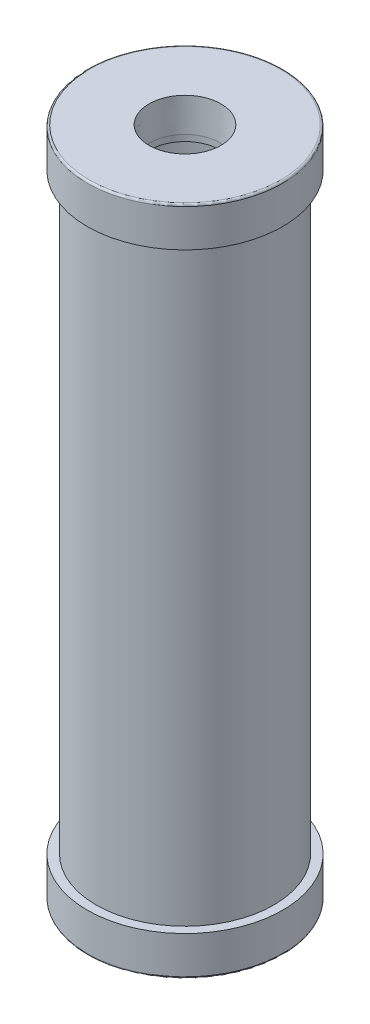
ISO-10303-21;
HEADER;
FILE_DESCRIPTION(('STEP AP214'),'2;1');
FILE_NAME('part.step','',(''),(''),'','','');
FILE_SCHEMA(('AUTOMOTIVE_DESIGN { 1 0 10303 214 1 1 1 1 }'));
ENDSEC;
DATA;
#1=APPLICATION_CONTEXT('core data for automotive mechanical design processes');
#2=APPLICATION_PROTOCOL_DEFINITION('international standard','automotive_design',2000,#1);
#3=PRODUCT_CONTEXT('',#1,'mechanical');
#4=PRODUCT('Part','Part','',(#3));
#5=PRODUCT_RELATED_PRODUCT_CATEGORY('part','',(#4));
#6=PRODUCT_DEFINITION_FORMATION('','',#4);
#7=PRODUCT_DEFINITION_CONTEXT('part definition',#1,'design');
#8=PRODUCT_DEFINITION('design','',#6,#7);
#9=PRODUCT_DEFINITION_SHAPE('','',#8);
#10=(LENGTH_UNIT() NAMED_UNIT(*) SI_UNIT(.MILLI.,.METRE.));
#11=(NAMED_UNIT(*) PLANE_ANGLE_UNIT() SI_UNIT($,.RADIAN.));
#12=(NAMED_UNIT(*) SI_UNIT($,.STERADIAN.) SOLID_ANGLE_UNIT());
#13=UNCERTAINTY_MEASURE_WITH_UNIT(LENGTH_MEASURE(1.E-05),#10,'distance_accuracy_value','');
#14=(GEOMETRIC_REPRESENTATION_CONTEXT(3) GLOBAL_UNCERTAINTY_ASSIGNED_CONTEXT((#13)) GLOBAL_UNIT_ASSIGNED_CONTEXT((#10,
#11,#12)) REPRESENTATION_CONTEXT('',''));
#15=CARTESIAN_POINT('',(0.,0.,0.));
#16=DIRECTION('',(0.,0.,1.));
#17=DIRECTION('',(1.,0.,0.));
#18=AXIS2_PLACEMENT_3D('',#15,#16,#17);
#19=CARTESIAN_POINT('',(0.,431.8,0.));
#20=DIRECTION('',(0.,-1.,0.));
#21=DIRECTION('',(0.,0.,-1.));
#22=AXIS2_PLACEMENT_3D('',#19,#20,#21);
#23=CYLINDRICAL_SURFACE('',#22,57.15);
#24=CARTESIAN_POINT('',(0.,25.4,0.));
#25=DIRECTION('',(0.,1.,0.));
#26=DIRECTION('',(0.,0.,1.));
#27=AXIS2_PLACEMENT_3D('',#24,#25,#26);
#28=CIRCLE('',#27,57.15);
#29=CARTESIAN_POINT('',(0.,25.4,57.15));
#30=VERTEX_POINT('',#29);
#31=EDGE_CURVE('E71',#30,#30,#28,.T.);
#32=ORIENTED_EDGE('',*,*,#31,.T.);
#33=EDGE_LOOP('',(#32));
#34=FACE_BOUND('',#33,.T.);
#35=CARTESIAN_POINT('',(0.,406.4,0.));
#36=DIRECTION('',(0.,1.,0.));
#37=DIRECTION('',(0.,0.,1.));
#38=AXIS2_PLACEMENT_3D('',#35,#36,#37);
#39=CIRCLE('',#38,57.15);
#40=CARTESIAN_POINT('',(0.,406.4,57.15));
#41=VERTEX_POINT('',#40);
#42=EDGE_CURVE('E53',#41,#41,#39,.T.);
#43=ORIENTED_EDGE('',*,*,#42,.F.);
#44=EDGE_LOOP('',(#43));
#45=FACE_BOUND('',#44,.T.);
#46=ADVANCED_FACE('F33',(#34,#45),#23,.T.);
#47=CARTESIAN_POINT('',(0.,431.8,0.));
#48=DIRECTION('',(0.,-1.,0.));
#49=DIRECTION('',(0.,0.,-1.));
#50=AXIS2_PLACEMENT_3D('',#47,#48,#49);
#51=CYLINDRICAL_SURFACE('',#50,50.546);
#52=CARTESIAN_POINT('',(0.,25.4,0.));
#53=DIRECTION('',(0.,1.,0.));
#54=DIRECTION('',(0.,0.,1.));
#55=AXIS2_PLACEMENT_3D('',#52,#53,#54);
#56=CIRCLE('',#55,50.546);
#57=CARTESIAN_POINT('',(0.,25.4,50.546));
#58=VERTEX_POINT('',#57);
#59=EDGE_CURVE('E68',#58,#58,#56,.T.);
#60=ORIENTED_EDGE('',*,*,#59,.F.);
#61=EDGE_LOOP('',(#60));
#62=FACE_BOUND('',#61,.T.);
#63=CARTESIAN_POINT('',(0.,406.4,0.));
#64=DIRECTION('',(0.,1.,0.));
#65=DIRECTION('',(0.,0.,1.));
#66=AXIS2_PLACEMENT_3D('',#63,#64,#65);
#67=CIRCLE('',#66,50.546);
#68=CARTESIAN_POINT('',(0.,406.4,50.546));
#69=VERTEX_POINT('',#68);
#70=EDGE_CURVE('E59',#69,#69,#67,.T.);
#71=ORIENTED_EDGE('',*,*,#70,.T.);
#72=EDGE_LOOP('',(#71));
#73=FACE_BOUND('',#72,.T.);
#74=ADVANCED_FACE('F115',(#62,#73),#51,.F.);
#75=CARTESIAN_POINT('',(0.,25.4,0.));
#76=DIRECTION('',(0.,1.,0.));
#77=DIRECTION('',(0.,0.,1.));
#78=AXIS2_PLACEMENT_3D('',#75,#76,#77);
#79=PLANE('',#78);
#80=CARTESIAN_POINT('',(0.,25.4,0.));
#81=DIRECTION('',(0.,1.,0.));
#82=DIRECTION('',(0.,0.,1.));
#83=AXIS2_PLACEMENT_3D('',#80,#81,#82);
#84=CIRCLE('',#83,22.6);
#85=CARTESIAN_POINT('',(0.,25.4,22.6));
#86=VERTEX_POINT('',#85);
#87=EDGE_CURVE('E63',#86,#86,#84,.T.);
#88=ORIENTED_EDGE('',*,*,#87,.F.);
#89=EDGE_LOOP('',(#88));
#90=FACE_BOUND('',#89,.T.);
#91=ORIENTED_EDGE('',*,*,#59,.T.);
#92=EDGE_LOOP('',(#91));
#93=FACE_BOUND('',#92,.T.);
#94=ADVANCED_FACE('F121',(#90,#93),#79,.T.);
#95=CARTESIAN_POINT('',(0.,25.4,0.));
#96=DIRECTION('',(0.,1.,0.));
#97=DIRECTION('',(0.,0.,1.));
#98=AXIS2_PLACEMENT_3D('',#95,#96,#97);
#99=CIRCLE('',#98,62.865);
#100=CARTESIAN_POINT('',(0.,25.4,62.865));
#101=VERTEX_POINT('',#100);
#102=EDGE_CURVE('E66',#101,#101,#99,.T.);
#103=ORIENTED_EDGE('',*,*,#102,.T.);
#104=EDGE_LOOP('',(#103));
#105=FACE_BOUND('',#104,.T.);
#106=ORIENTED_EDGE('',*,*,#31,.F.);
#107=EDGE_LOOP('',(#106));
#108=FACE_BOUND('',#107,.T.);
#109=ADVANCED_FACE('F142',(#105,#108),#79,.T.);
#110=CARTESIAN_POINT('',(0.,25.4,0.));
#111=DIRECTION('',(0.,-1.,0.));
#112=DIRECTION('',(0.,0.,-1.));
#113=AXIS2_PLACEMENT_3D('',#110,#111,#112);
#114=CYLINDRICAL_SURFACE('',#113,62.865);
#115=CARTESIAN_POINT('',(0.,1.27,0.));
#116=DIRECTION('',(0.,1.,0.));
#117=DIRECTION('',(0.,0.,1.));
#118=AXIS2_PLACEMENT_3D('',#115,#116,#117);
#119=CIRCLE('',#118,62.865);
#120=CARTESIAN_POINT('',(0.,1.27,62.865));
#121=VERTEX_POINT('',#120);
#122=EDGE_CURVE('E48',#121,#121,#119,.T.);
#123=ORIENTED_EDGE('',*,*,#122,.T.);
#124=EDGE_LOOP('',(#123));
#125=FACE_BOUND('',#124,.T.);
#126=ORIENTED_EDGE('',*,*,#102,.F.);
#127=EDGE_LOOP('',(#126));
#128=FACE_BOUND('',#127,.T.);
#129=ADVANCED_FACE('F139',(#125,#128),#114,.T.);
#130=CARTESIAN_POINT('',(0.,0.,0.));
#131=DIRECTION('',(0.,1.,0.));
#132=DIRECTION('',(0.,0.,1.));
#133=AXIS2_PLACEMENT_3D('',#130,#131,#132);
#134=PLANE('',#133);
#135=CARTESIAN_POINT('',(0.,0.,0.));
#136=DIRECTION('',(0.,1.,0.));
#137=DIRECTION('',(0.,0.,1.));
#138=AXIS2_PLACEMENT_3D('',#135,#136,#137);
#139=CIRCLE('',#138,61.595);
#140=CARTESIAN_POINT('',(0.,0.,61.595));
#141=VERTEX_POINT('',#140);
#142=EDGE_CURVE('E44',#141,#141,#139,.F.);
#143=ORIENTED_EDGE('',*,*,#142,.T.);
#144=EDGE_LOOP('',(#143));
#145=FACE_BOUND('',#144,.T.);
#146=CARTESIAN_POINT('',(0.,0.,0.));
#147=DIRECTION('',(0.,-1.,0.));
#148=DIRECTION('',(0.,0.,-1.));
#149=AXIS2_PLACEMENT_3D('',#146,#147,#148);
#150=CIRCLE('',#149,23.160002);
#151=CARTESIAN_POINT('',(0.,0.,-23.160002));
#152=VERTEX_POINT('',#151);
#153=EDGE_CURVE('E62',#152,#152,#150,.T.);
#154=ORIENTED_EDGE('',*,*,#153,.F.);
#155=EDGE_LOOP('',(#154));
#156=FACE_BOUND('',#155,.T.);
#157=ADVANCED_FACE('F124',(#145,#156),#134,.F.);
#158=CARTESIAN_POINT('',(0.,0.,0.));
#159=DIRECTION('',(0.,-1.,0.));
#160=DIRECTION('',(0.,0.,-1.));
#161=AXIS2_PLACEMENT_3D('',#158,#159,#160);
#162=CYLINDRICAL_SURFACE('',#161,22.6);
#163=ORIENTED_EDGE('',*,*,#87,.T.);
#164=EDGE_LOOP('',(#163));
#165=FACE_BOUND('',#164,.T.);
#166=CARTESIAN_POINT('',(0.,21.336,0.));
#167=DIRECTION('',(0.,-1.,0.));
#168=DIRECTION('',(0.,0.,-1.));
#169=AXIS2_PLACEMENT_3D('',#166,#167,#168);
#170=CIRCLE('',#169,22.6);
#171=CARTESIAN_POINT('',(0.,21.336,-22.6));
#172=VERTEX_POINT('',#171);
#173=EDGE_CURVE('E67',#172,#172,#170,.T.);
#174=ORIENTED_EDGE('',*,*,#173,.T.);
#175=EDGE_LOOP('',(#174));
#176=FACE_BOUND('',#175,.T.);
#177=ADVANCED_FACE('F155',(#165,#176),#162,.F.);
#178=CARTESIAN_POINT('',(22.6,21.336,0.));
#179=DIRECTION('',(0.,-1.,0.));
#180=DIRECTION('',(0.,0.,-1.));
#181=AXIS2_PLACEMENT_3D('',#178,#179,#180);
#182=PLANE('',#181);
#183=ORIENTED_EDGE('',*,*,#173,.F.);
#184=EDGE_LOOP('',(#183));
#185=FACE_BOUND('',#184,.T.);
#186=CARTESIAN_POINT('',(0.,21.336,0.));
#187=DIRECTION('',(0.,-1.,0.));
#188=DIRECTION('',(0.,0.,-1.));
#189=AXIS2_PLACEMENT_3D('',#186,#187,#188);
#190=CIRCLE('',#189,22.4939641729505);
#191=CARTESIAN_POINT('',(0.,21.336,-22.4939641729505));
#192=VERTEX_POINT('',#191);
#193=EDGE_CURVE('E78',#192,#192,#190,.T.);
#194=ORIENTED_EDGE('',*,*,#193,.T.);
#195=EDGE_LOOP('',(#194));
#196=FACE_BOUND('',#195,.T.);
#197=ADVANCED_FACE('F158',(#185,#196),#182,.F.);
#198=CARTESIAN_POINT('',(0.,0.,0.));
#199=DIRECTION('',(0.,-1.,0.));
#200=DIRECTION('',(0.,0.,-1.));
#201=AXIS2_PLACEMENT_3D('',#198,#199,#200);
#202=CONICAL_SURFACE('',#201,23.160002,0.0312064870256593);
#203=ORIENTED_EDGE('',*,*,#193,.F.);
#204=EDGE_LOOP('',(#203));
#205=FACE_BOUND('',#204,.T.);
#206=ORIENTED_EDGE('',*,*,#153,.T.);
#207=EDGE_LOOP('',(#206));
#208=FACE_BOUND('',#207,.T.);
#209=ADVANCED_FACE('F162',(#205,#208),#202,.F.);
#210=CARTESIAN_POINT('',(0.,406.4,0.));
#211=DIRECTION('',(0.,1.,0.));
#212=DIRECTION('',(0.,0.,1.));
#213=AXIS2_PLACEMENT_3D('',#210,#211,#212);
#214=PLANE('',#213);
#215=CARTESIAN_POINT('',(0.,406.4,0.));
#216=DIRECTION('',(0.,1.,0.));
#217=DIRECTION('',(0.,0.,1.));
#218=AXIS2_PLACEMENT_3D('',#215,#216,#217);
#219=CIRCLE('',#218,22.6);
#220=CARTESIAN_POINT('',(0.,406.4,22.6));
#221=VERTEX_POINT('',#220);
#222=EDGE_CURVE('E54',#221,#221,#219,.T.);
#223=ORIENTED_EDGE('',*,*,#222,.T.);
#224=EDGE_LOOP('',(#223));
#225=FACE_BOUND('',#224,.T.);
#226=ORIENTED_EDGE('',*,*,#70,.F.);
#227=EDGE_LOOP('',(#226));
#228=FACE_BOUND('',#227,.T.);
#229=ADVANCED_FACE('F165',(#225,#228),#214,.F.);
#230=CARTESIAN_POINT('',(0.,406.4,0.));
#231=DIRECTION('',(0.,1.,0.));
#232=DIRECTION('',(0.,0.,1.));
#233=AXIS2_PLACEMENT_3D('',#230,#231,#232);
#234=CIRCLE('',#233,62.865);
#235=CARTESIAN_POINT('',(0.,406.4,62.865));
#236=VERTEX_POINT('',#235);
#237=EDGE_CURVE('E57',#236,#236,#234,.T.);
#238=ORIENTED_EDGE('',*,*,#237,.F.);
#239=EDGE_LOOP('',(#238));
#240=FACE_BOUND('',#239,.T.);
#241=ORIENTED_EDGE('',*,*,#42,.T.);
#242=EDGE_LOOP('',(#241));
#243=FACE_BOUND('',#242,.T.);
#244=ADVANCED_FACE('F110',(#240,#243),#214,.F.);
#245=CARTESIAN_POINT('',(0.,406.4,0.));
#246=DIRECTION('',(0.,1.,0.));
#247=DIRECTION('',(0.,0.,1.));
#248=AXIS2_PLACEMENT_3D('',#245,#246,#247);
#249=CYLINDRICAL_SURFACE('',#248,62.865);
#250=CARTESIAN_POINT('',(0.,430.53,0.));
#251=DIRECTION('',(0.,1.,0.));
#252=DIRECTION('',(0.,0.,1.));
#253=AXIS2_PLACEMENT_3D('',#250,#251,#252);
#254=CIRCLE('',#253,62.865);
#255=CARTESIAN_POINT('',(0.,430.53,62.865));
#256=VERTEX_POINT('',#255);
#257=EDGE_CURVE('E10',#256,#256,#254,.F.);
#258=ORIENTED_EDGE('',*,*,#257,.T.);
#259=EDGE_LOOP('',(#258));
#260=FACE_BOUND('',#259,.T.);
#261=ORIENTED_EDGE('',*,*,#237,.T.);
#262=EDGE_LOOP('',(#261));
#263=FACE_BOUND('',#262,.T.);
#264=ADVANCED_FACE('F101',(#260,#263),#249,.T.);
#265=CARTESIAN_POINT('',(0.,431.8,0.));
#266=DIRECTION('',(0.,1.,0.));
#267=DIRECTION('',(0.,0.,1.));
#268=AXIS2_PLACEMENT_3D('',#265,#266,#267);
#269=PLANE('',#268);
#270=CARTESIAN_POINT('',(0.,431.8,0.));
#271=DIRECTION('',(0.,1.,0.));
#272=DIRECTION('',(0.,0.,1.));
#273=AXIS2_PLACEMENT_3D('',#270,#271,#272);
#274=CIRCLE('',#273,61.595);
#275=CARTESIAN_POINT('',(0.,431.8,61.595));
#276=VERTEX_POINT('',#275);
#277=EDGE_CURVE('E40',#276,#276,#274,.T.);
#278=ORIENTED_EDGE('',*,*,#277,.T.);
#279=EDGE_LOOP('',(#278));
#280=FACE_BOUND('',#279,.T.);
#281=CARTESIAN_POINT('',(0.,431.8,0.));
#282=DIRECTION('',(0.,1.,0.));
#283=DIRECTION('',(0.,0.,1.));
#284=AXIS2_PLACEMENT_3D('',#281,#282,#283);
#285=CIRCLE('',#284,23.160002);
#286=CARTESIAN_POINT('',(0.,431.8,23.160002));
#287=VERTEX_POINT('',#286);
#288=EDGE_CURVE('E92',#287,#287,#285,.T.);
#289=ORIENTED_EDGE('',*,*,#288,.F.);
#290=EDGE_LOOP('',(#289));
#291=FACE_BOUND('',#290,.T.);
#292=ADVANCED_FACE('F98',(#280,#291),#269,.T.);
#293=CARTESIAN_POINT('',(0.,431.8,0.));
#294=DIRECTION('',(0.,1.,0.));
#295=DIRECTION('',(0.,0.,1.));
#296=AXIS2_PLACEMENT_3D('',#293,#294,#295);
#297=CYLINDRICAL_SURFACE('',#296,22.6);
#298=CARTESIAN_POINT('',(0.,410.464,0.));
#299=DIRECTION('',(0.,1.,0.));
#300=DIRECTION('',(0.,0.,1.));
#301=AXIS2_PLACEMENT_3D('',#298,#299,#300);
#302=CIRCLE('',#301,22.6);
#303=CARTESIAN_POINT('',(0.,410.464,22.6));
#304=VERTEX_POINT('',#303);
#305=EDGE_CURVE('E58',#304,#304,#302,.T.);
#306=ORIENTED_EDGE('',*,*,#305,.T.);
#307=EDGE_LOOP('',(#306));
#308=FACE_BOUND('',#307,.T.);
#309=ORIENTED_EDGE('',*,*,#222,.F.);
#310=EDGE_LOOP('',(#309));
#311=FACE_BOUND('',#310,.T.);
#312=ADVANCED_FACE('F100',(#308,#311),#297,.F.);
#313=CARTESIAN_POINT('',(22.6,410.464,0.));
#314=DIRECTION('',(0.,1.,0.));
#315=DIRECTION('',(0.,0.,1.));
#316=AXIS2_PLACEMENT_3D('',#313,#314,#315);
#317=PLANE('',#316);
#318=ORIENTED_EDGE('',*,*,#305,.F.);
#319=EDGE_LOOP('',(#318));
#320=FACE_BOUND('',#319,.T.);
#321=CARTESIAN_POINT('',(0.,410.464,0.));
#322=DIRECTION('',(0.,1.,0.));
#323=DIRECTION('',(0.,0.,1.));
#324=AXIS2_PLACEMENT_3D('',#321,#322,#323);
#325=CIRCLE('',#324,22.4939641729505);
#326=CARTESIAN_POINT('',(0.,410.464,22.4939641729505));
#327=VERTEX_POINT('',#326);
#328=EDGE_CURVE('E89',#327,#327,#325,.T.);
#329=ORIENTED_EDGE('',*,*,#328,.T.);
#330=EDGE_LOOP('',(#329));
#331=FACE_BOUND('',#330,.T.);
#332=ADVANCED_FACE('F107',(#320,#331),#317,.F.);
#333=CARTESIAN_POINT('',(0.,431.8,0.));
#334=DIRECTION('',(0.,1.,0.));
#335=DIRECTION('',(0.,0.,1.));
#336=AXIS2_PLACEMENT_3D('',#333,#334,#335);
#337=CONICAL_SURFACE('',#336,23.160002,0.0312064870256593);
#338=ORIENTED_EDGE('',*,*,#328,.F.);
#339=EDGE_LOOP('',(#338));
#340=FACE_BOUND('',#339,.T.);
#341=ORIENTED_EDGE('',*,*,#288,.T.);
#342=EDGE_LOOP('',(#341));
#343=FACE_BOUND('',#342,.T.);
#344=ADVANCED_FACE('F96',(#340,#343),#337,.F.);
#345=CARTESIAN_POINT('',(0.,1.27,0.));
#346=DIRECTION('',(0.,1.,0.));
#347=DIRECTION('',(0.,0.,1.));
#348=AXIS2_PLACEMENT_3D('',#345,#346,#347);
#349=TOROIDAL_SURFACE('',#348,61.595,1.27);
#350=ORIENTED_EDGE('',*,*,#142,.F.);
#351=EDGE_LOOP('',(#350));
#352=FACE_BOUND('',#351,.T.);
#353=ORIENTED_EDGE('',*,*,#122,.F.);
#354=EDGE_LOOP('',(#353));
#355=FACE_BOUND('',#354,.T.);
#356=ADVANCED_FACE('F125',(#352,#355),#349,.T.);
#357=CARTESIAN_POINT('',(0.,430.53,0.));
#358=DIRECTION('',(0.,1.,0.));
#359=DIRECTION('',(0.,0.,1.));
#360=AXIS2_PLACEMENT_3D('',#357,#358,#359);
#361=TOROIDAL_SURFACE('',#360,61.595,1.27);
#362=ORIENTED_EDGE('',*,*,#257,.F.);
#363=EDGE_LOOP('',(#362));
#364=FACE_BOUND('',#363,.T.);
#365=ORIENTED_EDGE('',*,*,#277,.F.);
#366=EDGE_LOOP('',(#365));
#367=FACE_BOUND('',#366,.T.);
#368=ADVANCED_FACE('F35',(#364,#367),#361,.T.);
#369=CLOSED_SHELL('',(#46,#74,#94,#109,#129,#157,#177,#197,#209,#229,#244,#264,#292,#312,#332,
#344,#356,#368));
#370=MANIFOLD_SOLID_BREP('B2',#369);
#371=ADVANCED_BREP_SHAPE_REPRESENTATION('',(#18,#370),#14);
#372=SHAPE_DEFINITION_REPRESENTATION(#9,#371);
ENDSEC;
END-ISO-10303-21;
